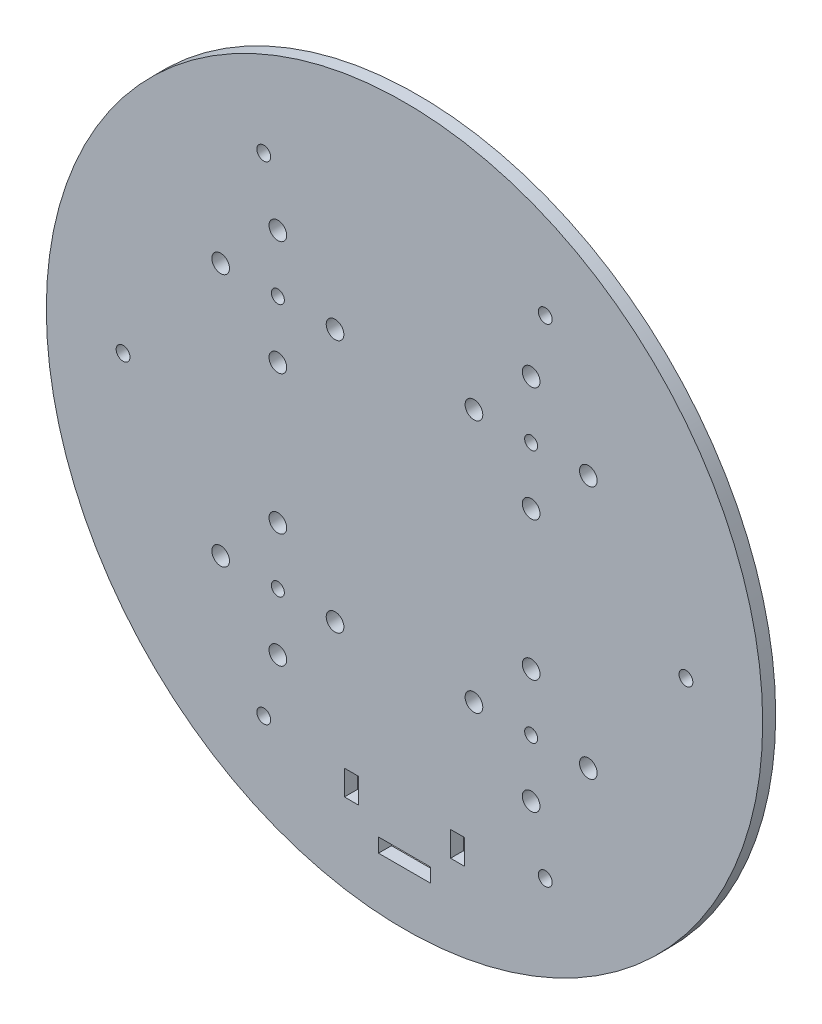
ISO-10303-21;
HEADER;
FILE_DESCRIPTION(('STEP AP214'),'2;1');
FILE_NAME('part.step','',(''),(''),'','','');
FILE_SCHEMA(('AUTOMOTIVE_DESIGN { 1 0 10303 214 1 1 1 1 }'));
ENDSEC;
DATA;
#1=APPLICATION_CONTEXT('core data for automotive mechanical design processes');
#2=APPLICATION_PROTOCOL_DEFINITION('international standard','automotive_design',2000,#1);
#3=PRODUCT_CONTEXT('',#1,'mechanical');
#4=PRODUCT('Part','Part','',(#3));
#5=PRODUCT_RELATED_PRODUCT_CATEGORY('part','',(#4));
#6=PRODUCT_DEFINITION_FORMATION('','',#4);
#7=PRODUCT_DEFINITION_CONTEXT('part definition',#1,'design');
#8=PRODUCT_DEFINITION('design','',#6,#7);
#9=PRODUCT_DEFINITION_SHAPE('','',#8);
#10=(LENGTH_UNIT() NAMED_UNIT(*) SI_UNIT(.MILLI.,.METRE.));
#11=(NAMED_UNIT(*) PLANE_ANGLE_UNIT() SI_UNIT($,.RADIAN.));
#12=(NAMED_UNIT(*) SI_UNIT($,.STERADIAN.) SOLID_ANGLE_UNIT());
#13=UNCERTAINTY_MEASURE_WITH_UNIT(LENGTH_MEASURE(1.E-05),#10,'distance_accuracy_value','');
#14=(GEOMETRIC_REPRESENTATION_CONTEXT(3) GLOBAL_UNCERTAINTY_ASSIGNED_CONTEXT((#13)) GLOBAL_UNIT_ASSIGNED_CONTEXT((#10,
#11,#12)) REPRESENTATION_CONTEXT('',''));
#15=CARTESIAN_POINT('',(0.,0.,0.));
#16=DIRECTION('',(0.,0.,1.));
#17=DIRECTION('',(1.,0.,0.));
#18=AXIS2_PLACEMENT_3D('',#15,#16,#17);
#19=CARTESIAN_POINT('',(0.,0.,0.));
#20=DIRECTION('',(0.,0.,1.));
#21=DIRECTION('',(1.,0.,0.));
#22=AXIS2_PLACEMENT_3D('',#19,#20,#21);
#23=PLANE('',#22);
#24=CARTESIAN_POINT('',(61.8718433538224,-89.8118433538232,0.));
#25=DIRECTION('',(0.,0.,1.));
#26=DIRECTION('',(1.,0.,0.));
#27=AXIS2_PLACEMENT_3D('',#24,#25,#26);
#28=CIRCLE('',#27,4.31800000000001);
#29=CARTESIAN_POINT('',(66.1898433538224,-89.8118433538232,0.));
#30=VERTEX_POINT('',#29);
#31=EDGE_CURVE('E463',#30,#30,#28,.T.);
#32=ORIENTED_EDGE('',*,*,#31,.T.);
#33=EDGE_LOOP('',(#32));
#34=FACE_BOUND('',#33,.T.);
#35=CARTESIAN_POINT('',(33.9318433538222,-61.8718433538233,0.));
#36=DIRECTION('',(0.,0.,1.));
#37=DIRECTION('',(1.,0.,0.));
#38=AXIS2_PLACEMENT_3D('',#35,#36,#37);
#39=CIRCLE('',#38,4.318);
#40=CARTESIAN_POINT('',(38.2498433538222,-61.8718433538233,0.));
#41=VERTEX_POINT('',#40);
#42=EDGE_CURVE('E455',#41,#41,#39,.T.);
#43=ORIENTED_EDGE('',*,*,#42,.T.);
#44=EDGE_LOOP('',(#43));
#45=FACE_BOUND('',#44,.T.);
#46=CARTESIAN_POINT('',(-33.9318433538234,-61.8718433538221,0.));
#47=DIRECTION('',(0.,0.,1.));
#48=DIRECTION('',(1.,0.,0.));
#49=AXIS2_PLACEMENT_3D('',#46,#47,#48);
#50=CIRCLE('',#49,4.31799999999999);
#51=CARTESIAN_POINT('',(-29.6138433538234,-61.8718433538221,0.));
#52=VERTEX_POINT('',#51);
#53=EDGE_CURVE('E447',#52,#52,#50,.T.);
#54=ORIENTED_EDGE('',*,*,#53,.T.);
#55=EDGE_LOOP('',(#54));
#56=FACE_BOUND('',#55,.T.);
#57=CARTESIAN_POINT('',(-61.8718433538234,-33.931843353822,0.));
#58=DIRECTION('',(0.,0.,1.));
#59=DIRECTION('',(1.,0.,0.));
#60=AXIS2_PLACEMENT_3D('',#57,#58,#59);
#61=CIRCLE('',#60,4.31800000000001);
#62=CARTESIAN_POINT('',(-57.5538433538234,-33.931843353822,0.));
#63=VERTEX_POINT('',#62);
#64=EDGE_CURVE('E438',#63,#63,#61,.T.);
#65=ORIENTED_EDGE('',*,*,#64,.T.);
#66=EDGE_LOOP('',(#65));
#67=FACE_BOUND('',#66,.T.);
#68=CARTESIAN_POINT('',(-61.8718433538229,-61.871843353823,0.));
#69=DIRECTION('',(0.,0.,1.));
#70=DIRECTION('',(1.,0.,0.));
#71=AXIS2_PLACEMENT_3D('',#68,#69,#70);
#72=CIRCLE('',#71,3.175);
#73=CARTESIAN_POINT('',(-58.6968433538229,-61.871843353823,0.));
#74=VERTEX_POINT('',#73);
#75=EDGE_CURVE('E486',#74,#74,#72,.T.);
#76=ORIENTED_EDGE('',*,*,#75,.T.);
#77=EDGE_LOOP('',(#76));
#78=FACE_BOUND('',#77,.T.);
#79=CARTESIAN_POINT('',(61.8718433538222,-33.9318433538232,0.));
#80=DIRECTION('',(0.,0.,1.));
#81=DIRECTION('',(1.,0.,0.));
#82=AXIS2_PLACEMENT_3D('',#79,#80,#81);
#83=CIRCLE('',#82,4.31800000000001);
#84=CARTESIAN_POINT('',(66.1898433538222,-33.9318433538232,0.));
#85=VERTEX_POINT('',#84);
#86=EDGE_CURVE('E495',#85,#85,#83,.T.);
#87=ORIENTED_EDGE('',*,*,#86,.T.);
#88=EDGE_LOOP('',(#87));
#89=FACE_BOUND('',#88,.T.);
#90=CARTESIAN_POINT('',(-61.8718433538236,-89.811843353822,0.));
#91=DIRECTION('',(0.,0.,1.));
#92=DIRECTION('',(1.,0.,0.));
#93=AXIS2_PLACEMENT_3D('',#90,#91,#92);
#94=CIRCLE('',#93,4.31799999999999);
#95=CARTESIAN_POINT('',(-57.5538433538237,-89.811843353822,0.));
#96=VERTEX_POINT('',#95);
#97=EDGE_CURVE('E470',#96,#96,#94,.T.);
#98=ORIENTED_EDGE('',*,*,#97,.T.);
#99=EDGE_LOOP('',(#98));
#100=FACE_BOUND('',#99,.T.);
#101=CARTESIAN_POINT('',(-89.8118433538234,-61.8718433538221,0.));
#102=DIRECTION('',(0.,0.,1.));
#103=DIRECTION('',(1.,0.,0.));
#104=AXIS2_PLACEMENT_3D('',#101,#102,#103);
#105=CIRCLE('',#104,4.31799999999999);
#106=CARTESIAN_POINT('',(-85.4938433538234,-61.8718433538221,0.));
#107=VERTEX_POINT('',#106);
#108=EDGE_CURVE('E479',#107,#107,#105,.T.);
#109=ORIENTED_EDGE('',*,*,#108,.T.);
#110=EDGE_LOOP('',(#109));
#111=FACE_BOUND('',#110,.T.);
#112=CARTESIAN_POINT('',(-89.8118433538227,61.8718433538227,0.));
#113=DIRECTION('',(0.,0.,1.));
#114=DIRECTION('',(1.,0.,0.));
#115=AXIS2_PLACEMENT_3D('',#112,#113,#114);
#116=CIRCLE('',#115,4.31799999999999);
#117=CARTESIAN_POINT('',(-85.4938433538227,61.8718433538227,0.));
#118=VERTEX_POINT('',#117);
#119=EDGE_CURVE('E399',#118,#118,#116,.T.);
#120=ORIENTED_EDGE('',*,*,#119,.T.);
#121=EDGE_LOOP('',(#120));
#122=FACE_BOUND('',#121,.T.);
#123=CARTESIAN_POINT('',(-61.8718433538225,33.9318433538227,0.));
#124=DIRECTION('',(0.,0.,1.));
#125=DIRECTION('',(1.,0.,0.));
#126=AXIS2_PLACEMENT_3D('',#123,#124,#125);
#127=CIRCLE('',#126,4.31800000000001);
#128=CARTESIAN_POINT('',(-57.5538433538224,33.9318433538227,0.));
#129=VERTEX_POINT('',#128);
#130=EDGE_CURVE('E391',#129,#129,#127,.T.);
#131=ORIENTED_EDGE('',*,*,#130,.T.);
#132=EDGE_LOOP('',(#131));
#133=FACE_BOUND('',#132,.T.);
#134=CARTESIAN_POINT('',(-33.9318433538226,61.8718433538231,0.));
#135=DIRECTION('',(0.,0.,1.));
#136=DIRECTION('',(1.,0.,0.));
#137=AXIS2_PLACEMENT_3D('',#134,#135,#136);
#138=CIRCLE('',#137,4.31800000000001);
#139=CARTESIAN_POINT('',(-29.6138433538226,61.8718433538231,0.));
#140=VERTEX_POINT('',#139);
#141=EDGE_CURVE('E383',#140,#140,#138,.T.);
#142=ORIENTED_EDGE('',*,*,#141,.T.);
#143=EDGE_LOOP('',(#142));
#144=FACE_BOUND('',#143,.T.);
#145=CARTESIAN_POINT('',(61.871843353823,89.8118433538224,0.));
#146=DIRECTION('',(0.,0.,1.));
#147=DIRECTION('',(1.,0.,0.));
#148=AXIS2_PLACEMENT_3D('',#145,#146,#147);
#149=CIRCLE('',#148,4.31799999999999);
#150=CARTESIAN_POINT('',(66.189843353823,89.8118433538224,0.));
#151=VERTEX_POINT('',#150);
#152=EDGE_CURVE('E374',#151,#151,#149,.T.);
#153=ORIENTED_EDGE('',*,*,#152,.T.);
#154=EDGE_LOOP('',(#153));
#155=FACE_BOUND('',#154,.T.);
#156=CARTESIAN_POINT('',(33.931843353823,61.8718433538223,0.));
#157=DIRECTION('',(0.,0.,1.));
#158=DIRECTION('',(1.,0.,0.));
#159=AXIS2_PLACEMENT_3D('',#156,#157,#158);
#160=CIRCLE('',#159,4.31800000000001);
#161=CARTESIAN_POINT('',(38.249843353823,61.8718433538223,0.));
#162=VERTEX_POINT('',#161);
#163=EDGE_CURVE('E431',#162,#162,#160,.T.);
#164=ORIENTED_EDGE('',*,*,#163,.T.);
#165=EDGE_LOOP('',(#164));
#166=FACE_BOUND('',#165,.T.);
#167=CARTESIAN_POINT('',(89.811843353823,61.8718433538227,0.));
#168=DIRECTION('',(0.,0.,1.));
#169=DIRECTION('',(1.,0.,0.));
#170=AXIS2_PLACEMENT_3D('',#167,#168,#169);
#171=CIRCLE('',#170,4.31800000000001);
#172=CARTESIAN_POINT('',(94.129843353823,61.8718433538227,0.));
#173=VERTEX_POINT('',#172);
#174=EDGE_CURVE('E423',#173,#173,#171,.T.);
#175=ORIENTED_EDGE('',*,*,#174,.T.);
#176=EDGE_LOOP('',(#175));
#177=FACE_BOUND('',#176,.T.);
#178=CARTESIAN_POINT('',(61.8718433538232,33.9318433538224,0.));
#179=DIRECTION('',(0.,0.,1.));
#180=DIRECTION('',(1.,0.,0.));
#181=AXIS2_PLACEMENT_3D('',#178,#179,#180);
#182=CIRCLE('',#181,4.31800000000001);
#183=CARTESIAN_POINT('',(66.1898433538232,33.9318433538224,0.));
#184=VERTEX_POINT('',#183);
#185=EDGE_CURVE('E415',#184,#184,#182,.T.);
#186=ORIENTED_EDGE('',*,*,#185,.T.);
#187=EDGE_LOOP('',(#186));
#188=FACE_BOUND('',#187,.T.);
#189=CARTESIAN_POINT('',(89.8118433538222,-61.8718433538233,0.));
#190=DIRECTION('',(0.,0.,1.));
#191=DIRECTION('',(1.,0.,0.));
#192=AXIS2_PLACEMENT_3D('',#189,#190,#191);
#193=CIRCLE('',#192,4.318);
#194=CARTESIAN_POINT('',(94.1298433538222,-61.8718433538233,0.));
#195=VERTEX_POINT('',#194);
#196=EDGE_CURVE('E406',#195,#195,#193,.T.);
#197=ORIENTED_EDGE('',*,*,#196,.T.);
#198=EDGE_LOOP('',(#197));
#199=FACE_BOUND('',#198,.T.);
#200=CARTESIAN_POINT('',(61.871843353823,61.8718433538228,0.));
#201=DIRECTION('',(0.,0.,1.));
#202=DIRECTION('',(1.,0.,0.));
#203=AXIS2_PLACEMENT_3D('',#200,#201,#202);
#204=CIRCLE('',#203,3.17499999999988);
#205=CARTESIAN_POINT('',(65.0468433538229,61.8718433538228,0.));
#206=VERTEX_POINT('',#205);
#207=EDGE_CURVE('E518',#206,#206,#204,.T.);
#208=ORIENTED_EDGE('',*,*,#207,.T.);
#209=EDGE_LOOP('',(#208));
#210=FACE_BOUND('',#209,.T.);
#211=CARTESIAN_POINT('',(61.8718433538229,-61.871843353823,0.));
#212=DIRECTION('',(0.,0.,1.));
#213=DIRECTION('',(1.,0.,0.));
#214=AXIS2_PLACEMENT_3D('',#211,#212,#213);
#215=CIRCLE('',#214,3.17500000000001);
#216=CARTESIAN_POINT('',(65.0468433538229,-61.871843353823,0.));
#217=VERTEX_POINT('',#216);
#218=EDGE_CURVE('E502',#217,#217,#215,.T.);
#219=ORIENTED_EDGE('',*,*,#218,.T.);
#220=EDGE_LOOP('',(#219));
#221=FACE_BOUND('',#220,.T.);
#222=CARTESIAN_POINT('',(-61.871843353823,61.8718433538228,0.));
#223=DIRECTION('',(0.,0.,1.));
#224=DIRECTION('',(1.,0.,0.));
#225=AXIS2_PLACEMENT_3D('',#222,#223,#224);
#226=CIRCLE('',#225,3.175);
#227=CARTESIAN_POINT('',(-58.696843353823,61.8718433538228,0.));
#228=VERTEX_POINT('',#227);
#229=EDGE_CURVE('E511',#228,#228,#226,.T.);
#230=ORIENTED_EDGE('',*,*,#229,.T.);
#231=EDGE_LOOP('',(#230));
#232=FACE_BOUND('',#231,.T.);
#233=CARTESIAN_POINT('',(-61.871843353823,89.8118433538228,0.));
#234=DIRECTION('',(0.,0.,1.));
#235=DIRECTION('',(1.,0.,0.));
#236=AXIS2_PLACEMENT_3D('',#233,#234,#235);
#237=CIRCLE('',#236,4.318);
#238=CARTESIAN_POINT('',(-57.553843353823,89.8118433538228,0.));
#239=VERTEX_POINT('',#238);
#240=EDGE_CURVE('E225',#239,#239,#237,.T.);
#241=ORIENTED_EDGE('',*,*,#240,.T.);
#242=EDGE_LOOP('',(#241));
#243=FACE_BOUND('',#242,.T.);
#244=DIRECTION('',(1.,0.,0.));
#245=VECTOR('',#244,1.);
#246=CARTESIAN_POINT('',(0.,-142.24999999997,0.));
#247=LINE('',#246,#245);
#248=CARTESIAN_POINT('',(-12.7000918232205,-142.24999999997,0.));
#249=VERTEX_POINT('',#248);
#250=CARTESIAN_POINT('',(12.6999081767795,-142.24999999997,0.));
#251=VERTEX_POINT('',#250);
#252=EDGE_CURVE('E273',#249,#251,#247,.T.);
#253=ORIENTED_EDGE('',*,*,#252,.F.);
#254=DIRECTION('',(0.,-1.,0.));
#255=VECTOR('',#254,1.);
#256=CARTESIAN_POINT('',(-12.7000918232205,0.,0.));
#257=LINE('',#256,#255);
#258=CARTESIAN_POINT('',(-12.7000918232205,-149.108014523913,0.));
#259=VERTEX_POINT('',#258);
#260=EDGE_CURVE('E262',#249,#259,#257,.T.);
#261=ORIENTED_EDGE('',*,*,#260,.T.);
#262=DIRECTION('',(1.,0.,0.));
#263=VECTOR('',#262,1.);
#264=CARTESIAN_POINT('',(0.,-149.108014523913,0.));
#265=LINE('',#264,#263);
#266=CARTESIAN_POINT('',(12.6999081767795,-149.108014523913,0.));
#267=VERTEX_POINT('',#266);
#268=EDGE_CURVE('E266',#259,#267,#265,.T.);
#269=ORIENTED_EDGE('',*,*,#268,.T.);
#270=DIRECTION('',(0.,-1.,0.));
#271=VECTOR('',#270,1.);
#272=CARTESIAN_POINT('',(12.6999081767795,0.,0.));
#273=LINE('',#272,#271);
#274=EDGE_CURVE('E270',#251,#267,#273,.T.);
#275=ORIENTED_EDGE('',*,*,#274,.F.);
#276=EDGE_LOOP('',(#253,#261,#269,#275));
#277=FACE_BOUND('',#276,.T.);
#278=CARTESIAN_POINT('',(0.,0.,0.));
#279=DIRECTION('',(0.,0.,1.));
#280=DIRECTION('',(1.,0.,0.));
#281=AXIS2_PLACEMENT_3D('',#278,#279,#280);
#282=CIRCLE('',#281,175.);
#283=CARTESIAN_POINT('',(175.,0.,0.));
#284=VERTEX_POINT('',#283);
#285=EDGE_CURVE('E66',#284,#284,#282,.T.);
#286=ORIENTED_EDGE('',*,*,#285,.F.);
#287=EDGE_LOOP('',(#286));
#288=FACE_BOUND('',#287,.T.);
#289=CARTESIAN_POINT('',(68.7499999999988,-119.078493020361,0.));
#290=DIRECTION('',(0.,0.,1.));
#291=DIRECTION('',(1.,0.,0.));
#292=AXIS2_PLACEMENT_3D('',#289,#290,#291);
#293=CIRCLE('',#292,3.375);
#294=CARTESIAN_POINT('',(72.1249999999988,-119.078493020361,0.));
#295=VERTEX_POINT('',#294);
#296=EDGE_CURVE('E329',#295,#295,#293,.T.);
#297=ORIENTED_EDGE('',*,*,#296,.T.);
#298=EDGE_LOOP('',(#297));
#299=FACE_BOUND('',#298,.T.);
#300=CARTESIAN_POINT('',(137.5,-1.0017831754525E-12,0.));
#301=DIRECTION('',(0.,0.,1.));
#302=DIRECTION('',(1.,0.,0.));
#303=AXIS2_PLACEMENT_3D('',#300,#301,#302);
#304=CIRCLE('',#303,3.375);
#305=CARTESIAN_POINT('',(140.875,-1.0017831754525E-12,0.));
#306=VERTEX_POINT('',#305);
#307=EDGE_CURVE('E326',#306,#306,#304,.T.);
#308=ORIENTED_EDGE('',*,*,#307,.T.);
#309=EDGE_LOOP('',(#308));
#310=FACE_BOUND('',#309,.T.);
#311=CARTESIAN_POINT('',(68.7500000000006,119.07849302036,0.));
#312=DIRECTION('',(0.,0.,1.));
#313=DIRECTION('',(1.,0.,0.));
#314=AXIS2_PLACEMENT_3D('',#311,#312,#313);
#315=CIRCLE('',#314,3.375);
#316=CARTESIAN_POINT('',(72.1250000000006,119.07849302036,0.));
#317=VERTEX_POINT('',#316);
#318=EDGE_CURVE('E322',#317,#317,#315,.T.);
#319=ORIENTED_EDGE('',*,*,#318,.T.);
#320=EDGE_LOOP('',(#319));
#321=FACE_BOUND('',#320,.T.);
#322=CARTESIAN_POINT('',(-68.7499999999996,119.07849302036,0.));
#323=DIRECTION('',(0.,0.,1.));
#324=DIRECTION('',(1.,0.,0.));
#325=AXIS2_PLACEMENT_3D('',#322,#323,#324);
#326=CIRCLE('',#325,3.375);
#327=CARTESIAN_POINT('',(-65.3749999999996,119.07849302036,0.));
#328=VERTEX_POINT('',#327);
#329=EDGE_CURVE('E318',#328,#328,#326,.T.);
#330=ORIENTED_EDGE('',*,*,#329,.T.);
#331=EDGE_LOOP('',(#330));
#332=FACE_BOUND('',#331,.T.);
#333=CARTESIAN_POINT('',(-137.5,0.,0.));
#334=DIRECTION('',(0.,0.,1.));
#335=DIRECTION('',(1.,0.,0.));
#336=AXIS2_PLACEMENT_3D('',#333,#334,#335);
#337=CIRCLE('',#336,3.375);
#338=CARTESIAN_POINT('',(-134.125,0.,0.));
#339=VERTEX_POINT('',#338);
#340=EDGE_CURVE('E314',#339,#339,#337,.T.);
#341=ORIENTED_EDGE('',*,*,#340,.T.);
#342=EDGE_LOOP('',(#341));
#343=FACE_BOUND('',#342,.T.);
#344=CARTESIAN_POINT('',(-68.7500000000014,-119.07849302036,0.));
#345=DIRECTION('',(0.,0.,1.));
#346=DIRECTION('',(1.,0.,0.));
#347=AXIS2_PLACEMENT_3D('',#344,#345,#346);
#348=CIRCLE('',#347,3.375);
#349=CARTESIAN_POINT('',(-65.3750000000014,-119.07849302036,0.));
#350=VERTEX_POINT('',#349);
#351=EDGE_CURVE('E287',#350,#350,#348,.T.);
#352=ORIENTED_EDGE('',*,*,#351,.T.);
#353=EDGE_LOOP('',(#352));
#354=FACE_BOUND('',#353,.T.);
#355=DIRECTION('',(-1.,0.,0.));
#356=VECTOR('',#355,1.);
#357=CARTESIAN_POINT('',(0.,-133.65,0.));
#358=LINE('',#357,#356);
#359=CARTESIAN_POINT('',(29.358,-133.65,0.));
#360=VERTEX_POINT('',#359);
#361=CARTESIAN_POINT('',(22.5,-133.65,0.));
#362=VERTEX_POINT('',#361);
#363=EDGE_CURVE('E259',#360,#362,#358,.T.);
#364=ORIENTED_EDGE('',*,*,#363,.F.);
#365=DIRECTION('',(0.,-1.,0.));
#366=VECTOR('',#365,1.);
#367=CARTESIAN_POINT('',(29.3580000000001,0.,0.));
#368=LINE('',#367,#366);
#369=CARTESIAN_POINT('',(29.358,-121.458,0.));
#370=VERTEX_POINT('',#369);
#371=EDGE_CURVE('E187',#370,#360,#368,.T.);
#372=ORIENTED_EDGE('',*,*,#371,.F.);
#373=DIRECTION('',(-1.,0.,0.));
#374=VECTOR('',#373,1.);
#375=CARTESIAN_POINT('',(0.,-121.458,0.));
#376=LINE('',#375,#374);
#377=CARTESIAN_POINT('',(22.5,-121.458,0.));
#378=VERTEX_POINT('',#377);
#379=EDGE_CURVE('E251',#370,#378,#376,.T.);
#380=ORIENTED_EDGE('',*,*,#379,.T.);
#381=DIRECTION('',(0.,-1.,0.));
#382=VECTOR('',#381,1.);
#383=CARTESIAN_POINT('',(22.4999999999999,0.,0.));
#384=LINE('',#383,#382);
#385=EDGE_CURVE('E255',#378,#362,#384,.T.);
#386=ORIENTED_EDGE('',*,*,#385,.T.);
#387=EDGE_LOOP('',(#364,#372,#380,#386));
#388=FACE_BOUND('',#387,.T.);
#389=DIRECTION('',(1.,0.,0.));
#390=VECTOR('',#389,1.);
#391=CARTESIAN_POINT('',(0.,-121.458,0.));
#392=LINE('',#391,#390);
#393=CARTESIAN_POINT('',(-29.358,-121.458,0.));
#394=VERTEX_POINT('',#393);
#395=CARTESIAN_POINT('',(-22.5,-121.458,0.));
#396=VERTEX_POINT('',#395);
#397=EDGE_CURVE('E284',#394,#396,#392,.T.);
#398=ORIENTED_EDGE('',*,*,#397,.F.);
#399=DIRECTION('',(0.,-1.,0.));
#400=VECTOR('',#399,1.);
#401=CARTESIAN_POINT('',(-29.358,0.,0.));
#402=LINE('',#401,#400);
#403=CARTESIAN_POINT('',(-29.358,-133.65,0.));
#404=VERTEX_POINT('',#403);
#405=EDGE_CURVE('E276',#394,#404,#402,.T.);
#406=ORIENTED_EDGE('',*,*,#405,.T.);
#407=DIRECTION('',(1.,0.,0.));
#408=VECTOR('',#407,1.);
#409=CARTESIAN_POINT('',(0.,-133.65,0.));
#410=LINE('',#409,#408);
#411=CARTESIAN_POINT('',(-22.5,-133.65,0.));
#412=VERTEX_POINT('',#411);
#413=EDGE_CURVE('E159',#404,#412,#410,.T.);
#414=ORIENTED_EDGE('',*,*,#413,.T.);
#415=DIRECTION('',(0.,-1.,0.));
#416=VECTOR('',#415,1.);
#417=CARTESIAN_POINT('',(-22.5,0.,0.));
#418=LINE('',#417,#416);
#419=EDGE_CURVE('E281',#396,#412,#418,.T.);
#420=ORIENTED_EDGE('',*,*,#419,.F.);
#421=EDGE_LOOP('',(#398,#406,#414,#420));
#422=FACE_BOUND('',#421,.T.);
#423=ADVANCED_FACE('F62',(#34,#45,#56,#67,#78,#89,#100,#111,#122,#133,#144,#155,#166,#177,#188,
#199,#210,#221,#232,#243,#277,#288,#299,#310,#321,#332,#343,#354,#388,#422),#23,.F.);
#424=CARTESIAN_POINT('',(0.,0.,6.35));
#425=DIRECTION('',(0.,0.,1.));
#426=DIRECTION('',(1.,0.,0.));
#427=AXIS2_PLACEMENT_3D('',#424,#425,#426);
#428=PLANE('',#427);
#429=CARTESIAN_POINT('',(61.8718433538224,-89.8118433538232,6.35));
#430=DIRECTION('',(0.,0.,1.));
#431=DIRECTION('',(1.,0.,0.));
#432=AXIS2_PLACEMENT_3D('',#429,#430,#431);
#433=CIRCLE('',#432,4.31800000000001);
#434=CARTESIAN_POINT('',(66.1898433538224,-89.8118433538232,6.35));
#435=VERTEX_POINT('',#434);
#436=EDGE_CURVE('E411',#435,#435,#433,.T.);
#437=ORIENTED_EDGE('',*,*,#436,.F.);
#438=EDGE_LOOP('',(#437));
#439=FACE_BOUND('',#438,.T.);
#440=CARTESIAN_POINT('',(33.9318433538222,-61.8718433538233,6.35));
#441=DIRECTION('',(0.,0.,1.));
#442=DIRECTION('',(1.,0.,0.));
#443=AXIS2_PLACEMENT_3D('',#440,#441,#442);
#444=CIRCLE('',#443,4.318);
#445=CARTESIAN_POINT('',(38.2498433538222,-61.8718433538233,6.35));
#446=VERTEX_POINT('',#445);
#447=EDGE_CURVE('E459',#446,#446,#444,.T.);
#448=ORIENTED_EDGE('',*,*,#447,.F.);
#449=EDGE_LOOP('',(#448));
#450=FACE_BOUND('',#449,.T.);
#451=CARTESIAN_POINT('',(-33.9318433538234,-61.8718433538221,6.35));
#452=DIRECTION('',(0.,0.,1.));
#453=DIRECTION('',(1.,0.,0.));
#454=AXIS2_PLACEMENT_3D('',#451,#452,#453);
#455=CIRCLE('',#454,4.31799999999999);
#456=CARTESIAN_POINT('',(-29.6138433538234,-61.8718433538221,6.35));
#457=VERTEX_POINT('',#456);
#458=EDGE_CURVE('E451',#457,#457,#455,.T.);
#459=ORIENTED_EDGE('',*,*,#458,.F.);
#460=EDGE_LOOP('',(#459));
#461=FACE_BOUND('',#460,.T.);
#462=CARTESIAN_POINT('',(-61.8718433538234,-33.931843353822,6.35));
#463=DIRECTION('',(0.,0.,1.));
#464=DIRECTION('',(1.,0.,0.));
#465=AXIS2_PLACEMENT_3D('',#462,#463,#464);
#466=CIRCLE('',#465,4.31800000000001);
#467=CARTESIAN_POINT('',(-57.5538433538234,-33.931843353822,6.35));
#468=VERTEX_POINT('',#467);
#469=EDGE_CURVE('E442',#468,#468,#466,.T.);
#470=ORIENTED_EDGE('',*,*,#469,.F.);
#471=EDGE_LOOP('',(#470));
#472=FACE_BOUND('',#471,.T.);
#473=CARTESIAN_POINT('',(-61.8718433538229,-61.871843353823,6.35));
#474=DIRECTION('',(0.,0.,1.));
#475=DIRECTION('',(1.,0.,0.));
#476=AXIS2_PLACEMENT_3D('',#473,#474,#475);
#477=CIRCLE('',#476,3.175);
#478=CARTESIAN_POINT('',(-58.6968433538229,-61.871843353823,6.35));
#479=VERTEX_POINT('',#478);
#480=EDGE_CURVE('E490',#479,#479,#477,.T.);
#481=ORIENTED_EDGE('',*,*,#480,.F.);
#482=EDGE_LOOP('',(#481));
#483=FACE_BOUND('',#482,.T.);
#484=CARTESIAN_POINT('',(61.8718433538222,-33.9318433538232,6.35));
#485=DIRECTION('',(0.,0.,1.));
#486=DIRECTION('',(1.,0.,0.));
#487=AXIS2_PLACEMENT_3D('',#484,#485,#486);
#488=CIRCLE('',#487,4.31800000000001);
#489=CARTESIAN_POINT('',(66.1898433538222,-33.9318433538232,6.35));
#490=VERTEX_POINT('',#489);
#491=EDGE_CURVE('E475',#490,#490,#488,.T.);
#492=ORIENTED_EDGE('',*,*,#491,.F.);
#493=EDGE_LOOP('',(#492));
#494=FACE_BOUND('',#493,.T.);
#495=CARTESIAN_POINT('',(-61.8718433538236,-89.811843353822,6.35));
#496=DIRECTION('',(0.,0.,1.));
#497=DIRECTION('',(1.,0.,0.));
#498=AXIS2_PLACEMENT_3D('',#495,#496,#497);
#499=CIRCLE('',#498,4.31799999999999);
#500=CARTESIAN_POINT('',(-57.5538433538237,-89.811843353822,6.35));
#501=VERTEX_POINT('',#500);
#502=EDGE_CURVE('E474',#501,#501,#499,.T.);
#503=ORIENTED_EDGE('',*,*,#502,.F.);
#504=EDGE_LOOP('',(#503));
#505=FACE_BOUND('',#504,.T.);
#506=CARTESIAN_POINT('',(-89.8118433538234,-61.8718433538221,6.35));
#507=DIRECTION('',(0.,0.,1.));
#508=DIRECTION('',(1.,0.,0.));
#509=AXIS2_PLACEMENT_3D('',#506,#507,#508);
#510=CIRCLE('',#509,4.31799999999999);
#511=CARTESIAN_POINT('',(-85.4938433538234,-61.8718433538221,6.35));
#512=VERTEX_POINT('',#511);
#513=EDGE_CURVE('E443',#512,#512,#510,.T.);
#514=ORIENTED_EDGE('',*,*,#513,.F.);
#515=EDGE_LOOP('',(#514));
#516=FACE_BOUND('',#515,.T.);
#517=CARTESIAN_POINT('',(-89.8118433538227,61.8718433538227,6.35));
#518=DIRECTION('',(0.,0.,1.));
#519=DIRECTION('',(1.,0.,0.));
#520=AXIS2_PLACEMENT_3D('',#517,#518,#519);
#521=CIRCLE('',#520,4.31799999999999);
#522=CARTESIAN_POINT('',(-85.4938433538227,61.8718433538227,6.35));
#523=VERTEX_POINT('',#522);
#524=EDGE_CURVE('E370',#523,#523,#521,.T.);
#525=ORIENTED_EDGE('',*,*,#524,.F.);
#526=EDGE_LOOP('',(#525));
#527=FACE_BOUND('',#526,.T.);
#528=CARTESIAN_POINT('',(-61.8718433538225,33.9318433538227,6.35));
#529=DIRECTION('',(0.,0.,1.));
#530=DIRECTION('',(1.,0.,0.));
#531=AXIS2_PLACEMENT_3D('',#528,#529,#530);
#532=CIRCLE('',#531,4.31800000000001);
#533=CARTESIAN_POINT('',(-57.5538433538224,33.9318433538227,6.35));
#534=VERTEX_POINT('',#533);
#535=EDGE_CURVE('E395',#534,#534,#532,.T.);
#536=ORIENTED_EDGE('',*,*,#535,.F.);
#537=EDGE_LOOP('',(#536));
#538=FACE_BOUND('',#537,.T.);
#539=CARTESIAN_POINT('',(-33.9318433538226,61.8718433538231,6.35));
#540=DIRECTION('',(0.,0.,1.));
#541=DIRECTION('',(1.,0.,0.));
#542=AXIS2_PLACEMENT_3D('',#539,#540,#541);
#543=CIRCLE('',#542,4.31800000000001);
#544=CARTESIAN_POINT('',(-29.6138433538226,61.8718433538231,6.35));
#545=VERTEX_POINT('',#544);
#546=EDGE_CURVE('E387',#545,#545,#543,.T.);
#547=ORIENTED_EDGE('',*,*,#546,.F.);
#548=EDGE_LOOP('',(#547));
#549=FACE_BOUND('',#548,.T.);
#550=CARTESIAN_POINT('',(61.871843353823,89.8118433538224,6.35));
#551=DIRECTION('',(0.,0.,1.));
#552=DIRECTION('',(1.,0.,0.));
#553=AXIS2_PLACEMENT_3D('',#550,#551,#552);
#554=CIRCLE('',#553,4.31799999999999);
#555=CARTESIAN_POINT('',(66.189843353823,89.8118433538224,6.35));
#556=VERTEX_POINT('',#555);
#557=EDGE_CURVE('E378',#556,#556,#554,.T.);
#558=ORIENTED_EDGE('',*,*,#557,.F.);
#559=EDGE_LOOP('',(#558));
#560=FACE_BOUND('',#559,.T.);
#561=CARTESIAN_POINT('',(33.931843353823,61.8718433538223,6.35));
#562=DIRECTION('',(0.,0.,1.));
#563=DIRECTION('',(1.,0.,0.));
#564=AXIS2_PLACEMENT_3D('',#561,#562,#563);
#565=CIRCLE('',#564,4.31800000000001);
#566=CARTESIAN_POINT('',(38.249843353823,61.8718433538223,6.35));
#567=VERTEX_POINT('',#566);
#568=EDGE_CURVE('E379',#567,#567,#565,.T.);
#569=ORIENTED_EDGE('',*,*,#568,.F.);
#570=EDGE_LOOP('',(#569));
#571=FACE_BOUND('',#570,.T.);
#572=CARTESIAN_POINT('',(89.811843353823,61.8718433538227,6.35));
#573=DIRECTION('',(0.,0.,1.));
#574=DIRECTION('',(1.,0.,0.));
#575=AXIS2_PLACEMENT_3D('',#572,#573,#574);
#576=CIRCLE('',#575,4.31800000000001);
#577=CARTESIAN_POINT('',(94.129843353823,61.8718433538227,6.35));
#578=VERTEX_POINT('',#577);
#579=EDGE_CURVE('E427',#578,#578,#576,.T.);
#580=ORIENTED_EDGE('',*,*,#579,.F.);
#581=EDGE_LOOP('',(#580));
#582=FACE_BOUND('',#581,.T.);
#583=CARTESIAN_POINT('',(61.8718433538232,33.9318433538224,6.35));
#584=DIRECTION('',(0.,0.,1.));
#585=DIRECTION('',(1.,0.,0.));
#586=AXIS2_PLACEMENT_3D('',#583,#584,#585);
#587=CIRCLE('',#586,4.31800000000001);
#588=CARTESIAN_POINT('',(66.1898433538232,33.9318433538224,6.35));
#589=VERTEX_POINT('',#588);
#590=EDGE_CURVE('E419',#589,#589,#587,.T.);
#591=ORIENTED_EDGE('',*,*,#590,.F.);
#592=EDGE_LOOP('',(#591));
#593=FACE_BOUND('',#592,.T.);
#594=CARTESIAN_POINT('',(89.8118433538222,-61.8718433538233,6.35));
#595=DIRECTION('',(0.,0.,1.));
#596=DIRECTION('',(1.,0.,0.));
#597=AXIS2_PLACEMENT_3D('',#594,#595,#596);
#598=CIRCLE('',#597,4.318);
#599=CARTESIAN_POINT('',(94.1298433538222,-61.8718433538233,6.35));
#600=VERTEX_POINT('',#599);
#601=EDGE_CURVE('E410',#600,#600,#598,.T.);
#602=ORIENTED_EDGE('',*,*,#601,.F.);
#603=EDGE_LOOP('',(#602));
#604=FACE_BOUND('',#603,.T.);
#605=CARTESIAN_POINT('',(61.871843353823,61.8718433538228,6.35));
#606=DIRECTION('',(0.,0.,1.));
#607=DIRECTION('',(1.,0.,0.));
#608=AXIS2_PLACEMENT_3D('',#605,#606,#607);
#609=CIRCLE('',#608,3.17499999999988);
#610=CARTESIAN_POINT('',(65.0468433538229,61.8718433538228,6.35));
#611=VERTEX_POINT('',#610);
#612=EDGE_CURVE('E507',#611,#611,#609,.T.);
#613=ORIENTED_EDGE('',*,*,#612,.F.);
#614=EDGE_LOOP('',(#613));
#615=FACE_BOUND('',#614,.T.);
#616=CARTESIAN_POINT('',(61.8718433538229,-61.871843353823,6.35));
#617=DIRECTION('',(0.,0.,1.));
#618=DIRECTION('',(1.,0.,0.));
#619=AXIS2_PLACEMENT_3D('',#616,#617,#618);
#620=CIRCLE('',#619,3.17500000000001);
#621=CARTESIAN_POINT('',(65.0468433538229,-61.871843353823,6.35));
#622=VERTEX_POINT('',#621);
#623=EDGE_CURVE('E506',#622,#622,#620,.T.);
#624=ORIENTED_EDGE('',*,*,#623,.F.);
#625=EDGE_LOOP('',(#624));
#626=FACE_BOUND('',#625,.T.);
#627=CARTESIAN_POINT('',(-61.871843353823,61.8718433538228,6.35));
#628=DIRECTION('',(0.,0.,1.));
#629=DIRECTION('',(1.,0.,0.));
#630=AXIS2_PLACEMENT_3D('',#627,#628,#629);
#631=CIRCLE('',#630,3.175);
#632=CARTESIAN_POINT('',(-58.696843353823,61.8718433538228,6.35));
#633=VERTEX_POINT('',#632);
#634=EDGE_CURVE('E491',#633,#633,#631,.T.);
#635=ORIENTED_EDGE('',*,*,#634,.F.);
#636=EDGE_LOOP('',(#635));
#637=FACE_BOUND('',#636,.T.);
#638=CARTESIAN_POINT('',(-61.871843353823,89.8118433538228,6.35));
#639=DIRECTION('',(0.,0.,1.));
#640=DIRECTION('',(1.,0.,0.));
#641=AXIS2_PLACEMENT_3D('',#638,#639,#640);
#642=CIRCLE('',#641,4.318);
#643=CARTESIAN_POINT('',(-57.553843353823,89.8118433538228,6.35));
#644=VERTEX_POINT('',#643);
#645=EDGE_CURVE('E366',#644,#644,#642,.T.);
#646=ORIENTED_EDGE('',*,*,#645,.F.);
#647=EDGE_LOOP('',(#646));
#648=FACE_BOUND('',#647,.T.);
#649=CARTESIAN_POINT('',(-68.7500000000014,-119.07849302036,6.35));
#650=DIRECTION('',(0.,0.,1.));
#651=DIRECTION('',(1.,0.,0.));
#652=AXIS2_PLACEMENT_3D('',#649,#650,#651);
#653=CIRCLE('',#652,3.375);
#654=CARTESIAN_POINT('',(-65.3750000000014,-119.07849302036,6.35));
#655=VERTEX_POINT('',#654);
#656=EDGE_CURVE('E288',#655,#655,#653,.T.);
#657=ORIENTED_EDGE('',*,*,#656,.F.);
#658=EDGE_LOOP('',(#657));
#659=FACE_BOUND('',#658,.T.);
#660=CARTESIAN_POINT('',(-137.5,0.,6.35));
#661=DIRECTION('',(0.,0.,1.));
#662=DIRECTION('',(1.,0.,0.));
#663=AXIS2_PLACEMENT_3D('',#660,#661,#662);
#664=CIRCLE('',#663,3.375);
#665=CARTESIAN_POINT('',(-134.125,0.,6.35));
#666=VERTEX_POINT('',#665);
#667=EDGE_CURVE('E292',#666,#666,#664,.T.);
#668=ORIENTED_EDGE('',*,*,#667,.F.);
#669=EDGE_LOOP('',(#668));
#670=FACE_BOUND('',#669,.T.);
#671=CARTESIAN_POINT('',(-68.7499999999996,119.07849302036,6.35));
#672=DIRECTION('',(0.,0.,1.));
#673=DIRECTION('',(1.,0.,0.));
#674=AXIS2_PLACEMENT_3D('',#671,#672,#673);
#675=CIRCLE('',#674,3.375);
#676=CARTESIAN_POINT('',(-65.3749999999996,119.07849302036,6.35));
#677=VERTEX_POINT('',#676);
#678=EDGE_CURVE('E296',#677,#677,#675,.T.);
#679=ORIENTED_EDGE('',*,*,#678,.F.);
#680=EDGE_LOOP('',(#679));
#681=FACE_BOUND('',#680,.T.);
#682=CARTESIAN_POINT('',(68.7500000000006,119.07849302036,6.35));
#683=DIRECTION('',(0.,0.,1.));
#684=DIRECTION('',(1.,0.,0.));
#685=AXIS2_PLACEMENT_3D('',#682,#683,#684);
#686=CIRCLE('',#685,3.375);
#687=CARTESIAN_POINT('',(72.1250000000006,119.07849302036,6.35));
#688=VERTEX_POINT('',#687);
#689=EDGE_CURVE('E300',#688,#688,#686,.T.);
#690=ORIENTED_EDGE('',*,*,#689,.F.);
#691=EDGE_LOOP('',(#690));
#692=FACE_BOUND('',#691,.T.);
#693=CARTESIAN_POINT('',(137.5,-1.0017831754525E-12,6.35));
#694=DIRECTION('',(0.,0.,1.));
#695=DIRECTION('',(1.,0.,0.));
#696=AXIS2_PLACEMENT_3D('',#693,#694,#695);
#697=CIRCLE('',#696,3.375);
#698=CARTESIAN_POINT('',(140.875,-1.0017831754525E-12,6.35));
#699=VERTEX_POINT('',#698);
#700=EDGE_CURVE('E304',#699,#699,#697,.T.);
#701=ORIENTED_EDGE('',*,*,#700,.F.);
#702=EDGE_LOOP('',(#701));
#703=FACE_BOUND('',#702,.T.);
#704=CARTESIAN_POINT('',(68.7499999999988,-119.078493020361,6.35));
#705=DIRECTION('',(0.,0.,1.));
#706=DIRECTION('',(1.,0.,0.));
#707=AXIS2_PLACEMENT_3D('',#704,#705,#706);
#708=CIRCLE('',#707,3.375);
#709=CARTESIAN_POINT('',(72.1249999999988,-119.078493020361,6.35));
#710=VERTEX_POINT('',#709);
#711=EDGE_CURVE('E72',#710,#710,#708,.T.);
#712=ORIENTED_EDGE('',*,*,#711,.F.);
#713=EDGE_LOOP('',(#712));
#714=FACE_BOUND('',#713,.T.);
#715=CARTESIAN_POINT('',(0.,0.,6.35));
#716=DIRECTION('',(0.,0.,1.));
#717=DIRECTION('',(1.,0.,0.));
#718=AXIS2_PLACEMENT_3D('',#715,#716,#717);
#719=CIRCLE('',#718,175.);
#720=CARTESIAN_POINT('',(175.,0.,6.35));
#721=VERTEX_POINT('',#720);
#722=EDGE_CURVE('E12',#721,#721,#719,.T.);
#723=ORIENTED_EDGE('',*,*,#722,.T.);
#724=EDGE_LOOP('',(#723));
#725=FACE_BOUND('',#724,.T.);
#726=DIRECTION('',(0.,-1.,0.));
#727=VECTOR('',#726,1.);
#728=CARTESIAN_POINT('',(29.3580000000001,0.,6.35));
#729=LINE('',#728,#727);
#730=CARTESIAN_POINT('',(29.358,-121.458,6.35));
#731=VERTEX_POINT('',#730);
#732=CARTESIAN_POINT('',(29.358,-133.65,6.35));
#733=VERTEX_POINT('',#732);
#734=EDGE_CURVE('E224',#731,#733,#729,.T.);
#735=ORIENTED_EDGE('',*,*,#734,.T.);
#736=DIRECTION('',(-1.,0.,0.));
#737=VECTOR('',#736,1.);
#738=CARTESIAN_POINT('',(0.,-133.65,6.35));
#739=LINE('',#738,#737);
#740=CARTESIAN_POINT('',(22.5,-133.65,6.35));
#741=VERTEX_POINT('',#740);
#742=EDGE_CURVE('E220',#733,#741,#739,.T.);
#743=ORIENTED_EDGE('',*,*,#742,.T.);
#744=DIRECTION('',(0.,-1.,0.));
#745=VECTOR('',#744,1.);
#746=CARTESIAN_POINT('',(22.4999999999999,0.,6.35));
#747=LINE('',#746,#745);
#748=CARTESIAN_POINT('',(22.5,-121.458,6.35));
#749=VERTEX_POINT('',#748);
#750=EDGE_CURVE('E233',#749,#741,#747,.T.);
#751=ORIENTED_EDGE('',*,*,#750,.F.);
#752=DIRECTION('',(-1.,0.,0.));
#753=VECTOR('',#752,1.);
#754=CARTESIAN_POINT('',(0.,-121.458,6.35));
#755=LINE('',#754,#753);
#756=EDGE_CURVE('E229',#731,#749,#755,.T.);
#757=ORIENTED_EDGE('',*,*,#756,.F.);
#758=EDGE_LOOP('',(#735,#743,#751,#757));
#759=FACE_BOUND('',#758,.T.);
#760=DIRECTION('',(0.,-1.,0.));
#761=VECTOR('',#760,1.);
#762=CARTESIAN_POINT('',(-12.7000918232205,0.,6.35));
#763=LINE('',#762,#761);
#764=CARTESIAN_POINT('',(-12.7000918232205,-142.24999999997,6.35));
#765=VERTEX_POINT('',#764);
#766=CARTESIAN_POINT('',(-12.7000918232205,-149.108014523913,6.35));
#767=VERTEX_POINT('',#766);
#768=EDGE_CURVE('E196',#765,#767,#763,.T.);
#769=ORIENTED_EDGE('',*,*,#768,.F.);
#770=DIRECTION('',(1.,0.,0.));
#771=VECTOR('',#770,1.);
#772=CARTESIAN_POINT('',(0.,-142.24999999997,6.35));
#773=LINE('',#772,#771);
#774=CARTESIAN_POINT('',(12.6999081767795,-142.24999999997,6.35));
#775=VERTEX_POINT('',#774);
#776=EDGE_CURVE('E192',#765,#775,#773,.T.);
#777=ORIENTED_EDGE('',*,*,#776,.T.);
#778=DIRECTION('',(0.,-1.,0.));
#779=VECTOR('',#778,1.);
#780=CARTESIAN_POINT('',(12.6999081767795,0.,6.35));
#781=LINE('',#780,#779);
#782=CARTESIAN_POINT('',(12.6999081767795,-149.108014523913,6.35));
#783=VERTEX_POINT('',#782);
#784=EDGE_CURVE('E204',#775,#783,#781,.T.);
#785=ORIENTED_EDGE('',*,*,#784,.T.);
#786=DIRECTION('',(1.,0.,0.));
#787=VECTOR('',#786,1.);
#788=CARTESIAN_POINT('',(0.,-149.108014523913,6.35));
#789=LINE('',#788,#787);
#790=EDGE_CURVE('E200',#767,#783,#789,.T.);
#791=ORIENTED_EDGE('',*,*,#790,.F.);
#792=EDGE_LOOP('',(#769,#777,#785,#791));
#793=FACE_BOUND('',#792,.T.);
#794=DIRECTION('',(0.,-1.,0.));
#795=VECTOR('',#794,1.);
#796=CARTESIAN_POINT('',(-29.358,0.,6.35));
#797=LINE('',#796,#795);
#798=CARTESIAN_POINT('',(-29.358,-121.458,6.35));
#799=VERTEX_POINT('',#798);
#800=CARTESIAN_POINT('',(-29.358,-133.65,6.35));
#801=VERTEX_POINT('',#800);
#802=EDGE_CURVE('E167',#799,#801,#797,.T.);
#803=ORIENTED_EDGE('',*,*,#802,.F.);
#804=DIRECTION('',(1.,0.,0.));
#805=VECTOR('',#804,1.);
#806=CARTESIAN_POINT('',(0.,-121.458,6.35));
#807=LINE('',#806,#805);
#808=CARTESIAN_POINT('',(-22.5,-121.458,6.35));
#809=VERTEX_POINT('',#808);
#810=EDGE_CURVE('E173',#799,#809,#807,.T.);
#811=ORIENTED_EDGE('',*,*,#810,.T.);
#812=DIRECTION('',(0.,-1.,0.));
#813=VECTOR('',#812,1.);
#814=CARTESIAN_POINT('',(-22.5,0.,6.35));
#815=LINE('',#814,#813);
#816=CARTESIAN_POINT('',(-22.5,-133.65,6.35));
#817=VERTEX_POINT('',#816);
#818=EDGE_CURVE('E177',#809,#817,#815,.T.);
#819=ORIENTED_EDGE('',*,*,#818,.T.);
#820=DIRECTION('',(1.,0.,0.));
#821=VECTOR('',#820,1.);
#822=CARTESIAN_POINT('',(0.,-133.65,6.35));
#823=LINE('',#822,#821);
#824=EDGE_CURVE('E156',#801,#817,#823,.T.);
#825=ORIENTED_EDGE('',*,*,#824,.F.);
#826=EDGE_LOOP('',(#803,#811,#819,#825));
#827=FACE_BOUND('',#826,.T.);
#828=ADVANCED_FACE('F175',(#439,#450,#461,#472,#483,#494,#505,#516,#527,#538,#549,#560,#571,
#582,#593,#604,#615,#626,#637,#648,#659,#670,#681,#692,#703,#714,#725,#759,#793,#827),#428,.T.);
#829=CARTESIAN_POINT('',(0.,0.,6.35));
#830=DIRECTION('',(0.,0.,-1.));
#831=DIRECTION('',(-1.,0.,0.));
#832=AXIS2_PLACEMENT_3D('',#829,#830,#831);
#833=CYLINDRICAL_SURFACE('',#832,175.);
#834=ORIENTED_EDGE('',*,*,#722,.F.);
#835=EDGE_LOOP('',(#834));
#836=FACE_BOUND('',#835,.T.);
#837=ORIENTED_EDGE('',*,*,#285,.T.);
#838=EDGE_LOOP('',(#837));
#839=FACE_BOUND('',#838,.T.);
#840=ADVANCED_FACE('F338',(#836,#839),#833,.T.);
#841=CARTESIAN_POINT('',(68.7499999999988,-119.078493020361,6.35));
#842=DIRECTION('',(0.,0.,-1.));
#843=DIRECTION('',(-1.,0.,0.));
#844=AXIS2_PLACEMENT_3D('',#841,#842,#843);
#845=CYLINDRICAL_SURFACE('',#844,3.375);
#846=ORIENTED_EDGE('',*,*,#711,.T.);
#847=EDGE_LOOP('',(#846));
#848=FACE_BOUND('',#847,.T.);
#849=ORIENTED_EDGE('',*,*,#296,.F.);
#850=EDGE_LOOP('',(#849));
#851=FACE_BOUND('',#850,.T.);
#852=ADVANCED_FACE('F601',(#848,#851),#845,.F.);
#853=CARTESIAN_POINT('',(137.5,-1.0017831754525E-12,6.35));
#854=DIRECTION('',(0.,0.,-1.));
#855=DIRECTION('',(-1.,0.,0.));
#856=AXIS2_PLACEMENT_3D('',#853,#854,#855);
#857=CYLINDRICAL_SURFACE('',#856,3.375);
#858=ORIENTED_EDGE('',*,*,#700,.T.);
#859=EDGE_LOOP('',(#858));
#860=FACE_BOUND('',#859,.T.);
#861=ORIENTED_EDGE('',*,*,#307,.F.);
#862=EDGE_LOOP('',(#861));
#863=FACE_BOUND('',#862,.T.);
#864=ADVANCED_FACE('F605',(#860,#863),#857,.F.);
#865=CARTESIAN_POINT('',(68.7500000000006,119.07849302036,6.35));
#866=DIRECTION('',(0.,0.,-1.));
#867=DIRECTION('',(-1.,0.,0.));
#868=AXIS2_PLACEMENT_3D('',#865,#866,#867);
#869=CYLINDRICAL_SURFACE('',#868,3.375);
#870=ORIENTED_EDGE('',*,*,#689,.T.);
#871=EDGE_LOOP('',(#870));
#872=FACE_BOUND('',#871,.T.);
#873=ORIENTED_EDGE('',*,*,#318,.F.);
#874=EDGE_LOOP('',(#873));
#875=FACE_BOUND('',#874,.T.);
#876=ADVANCED_FACE('F609',(#872,#875),#869,.F.);
#877=CARTESIAN_POINT('',(-68.7499999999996,119.07849302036,6.35));
#878=DIRECTION('',(0.,0.,-1.));
#879=DIRECTION('',(-1.,0.,0.));
#880=AXIS2_PLACEMENT_3D('',#877,#878,#879);
#881=CYLINDRICAL_SURFACE('',#880,3.375);
#882=ORIENTED_EDGE('',*,*,#678,.T.);
#883=EDGE_LOOP('',(#882));
#884=FACE_BOUND('',#883,.T.);
#885=ORIENTED_EDGE('',*,*,#329,.F.);
#886=EDGE_LOOP('',(#885));
#887=FACE_BOUND('',#886,.T.);
#888=ADVANCED_FACE('F613',(#884,#887),#881,.F.);
#889=CARTESIAN_POINT('',(-137.5,0.,6.35));
#890=DIRECTION('',(0.,0.,-1.));
#891=DIRECTION('',(-1.,0.,0.));
#892=AXIS2_PLACEMENT_3D('',#889,#890,#891);
#893=CYLINDRICAL_SURFACE('',#892,3.375);
#894=ORIENTED_EDGE('',*,*,#667,.T.);
#895=EDGE_LOOP('',(#894));
#896=FACE_BOUND('',#895,.T.);
#897=ORIENTED_EDGE('',*,*,#340,.F.);
#898=EDGE_LOOP('',(#897));
#899=FACE_BOUND('',#898,.T.);
#900=ADVANCED_FACE('F616',(#896,#899),#893,.F.);
#901=CARTESIAN_POINT('',(-68.7500000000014,-119.07849302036,6.35));
#902=DIRECTION('',(0.,0.,-1.));
#903=DIRECTION('',(-1.,0.,0.));
#904=AXIS2_PLACEMENT_3D('',#901,#902,#903);
#905=CYLINDRICAL_SURFACE('',#904,3.375);
#906=ORIENTED_EDGE('',*,*,#656,.T.);
#907=EDGE_LOOP('',(#906));
#908=FACE_BOUND('',#907,.T.);
#909=ORIENTED_EDGE('',*,*,#351,.F.);
#910=EDGE_LOOP('',(#909));
#911=FACE_BOUND('',#910,.T.);
#912=ADVANCED_FACE('F64',(#908,#911),#905,.F.);
#913=CARTESIAN_POINT('',(0.,-133.65,-3.65));
#914=DIRECTION('',(0.,1.,0.));
#915=DIRECTION('',(0.,0.,1.));
#916=AXIS2_PLACEMENT_3D('',#913,#914,#915);
#917=PLANE('',#916);
#918=ORIENTED_EDGE('',*,*,#363,.T.);
#919=DIRECTION('',(0.,0.,1.));
#920=VECTOR('',#919,1.);
#921=CARTESIAN_POINT('',(22.5,-133.65,-3.65));
#922=LINE('',#921,#920);
#923=EDGE_CURVE('E197',#362,#741,#922,.T.);
#924=ORIENTED_EDGE('',*,*,#923,.T.);
#925=ORIENTED_EDGE('',*,*,#742,.F.);
#926=DIRECTION('',(0.,0.,1.));
#927=VECTOR('',#926,1.);
#928=CARTESIAN_POINT('',(29.358,-133.65,-3.65));
#929=LINE('',#928,#927);
#930=EDGE_CURVE('E237',#360,#733,#929,.T.);
#931=ORIENTED_EDGE('',*,*,#930,.F.);
#932=EDGE_LOOP('',(#918,#924,#925,#931));
#933=FACE_BOUND('',#932,.T.);
#934=ADVANCED_FACE('F588',(#933),#917,.T.);
#935=CARTESIAN_POINT('',(22.4999999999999,0.,-3.65));
#936=DIRECTION('',(-1.,0.,0.));
#937=DIRECTION('',(0.,-1.,0.));
#938=AXIS2_PLACEMENT_3D('',#935,#936,#937);
#939=PLANE('',#938);
#940=DIRECTION('',(0.,0.,1.));
#941=VECTOR('',#940,1.);
#942=CARTESIAN_POINT('',(22.5,-121.458,-3.65));
#943=LINE('',#942,#941);
#944=EDGE_CURVE('E240',#378,#749,#943,.T.);
#945=ORIENTED_EDGE('',*,*,#944,.T.);
#946=ORIENTED_EDGE('',*,*,#750,.T.);
#947=ORIENTED_EDGE('',*,*,#923,.F.);
#948=ORIENTED_EDGE('',*,*,#385,.F.);
#949=EDGE_LOOP('',(#945,#946,#947,#948));
#950=FACE_BOUND('',#949,.T.);
#951=ADVANCED_FACE('F584',(#950),#939,.F.);
#952=CARTESIAN_POINT('',(0.,-121.458,-3.65));
#953=DIRECTION('',(0.,1.,0.));
#954=DIRECTION('',(0.,0.,1.));
#955=AXIS2_PLACEMENT_3D('',#952,#953,#954);
#956=PLANE('',#955);
#957=DIRECTION('',(0.,0.,1.));
#958=VECTOR('',#957,1.);
#959=CARTESIAN_POINT('',(29.358,-121.458,-3.65));
#960=LINE('',#959,#958);
#961=EDGE_CURVE('E243',#370,#731,#960,.T.);
#962=ORIENTED_EDGE('',*,*,#961,.T.);
#963=ORIENTED_EDGE('',*,*,#756,.T.);
#964=ORIENTED_EDGE('',*,*,#944,.F.);
#965=ORIENTED_EDGE('',*,*,#379,.F.);
#966=EDGE_LOOP('',(#962,#963,#964,#965));
#967=FACE_BOUND('',#966,.T.);
#968=ADVANCED_FACE('F587',(#967),#956,.F.);
#969=CARTESIAN_POINT('',(29.3580000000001,0.,-3.65));
#970=DIRECTION('',(-1.,0.,0.));
#971=DIRECTION('',(0.,-1.,0.));
#972=AXIS2_PLACEMENT_3D('',#969,#970,#971);
#973=PLANE('',#972);
#974=ORIENTED_EDGE('',*,*,#371,.T.);
#975=ORIENTED_EDGE('',*,*,#930,.T.);
#976=ORIENTED_EDGE('',*,*,#734,.F.);
#977=ORIENTED_EDGE('',*,*,#961,.F.);
#978=EDGE_LOOP('',(#974,#975,#976,#977));
#979=FACE_BOUND('',#978,.T.);
#980=ADVANCED_FACE('F583',(#979),#973,.T.);
#981=CARTESIAN_POINT('',(0.,-142.24999999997,-3.65));
#982=DIRECTION('',(0.,-1.,0.));
#983=DIRECTION('',(0.,0.,-1.));
#984=AXIS2_PLACEMENT_3D('',#981,#982,#983);
#985=PLANE('',#984);
#986=ORIENTED_EDGE('',*,*,#252,.T.);
#987=DIRECTION('',(0.,0.,1.));
#988=VECTOR('',#987,1.);
#989=CARTESIAN_POINT('',(12.6999081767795,-142.24999999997,-3.65));
#990=LINE('',#989,#988);
#991=EDGE_CURVE('E209',#251,#775,#990,.T.);
#992=ORIENTED_EDGE('',*,*,#991,.T.);
#993=ORIENTED_EDGE('',*,*,#776,.F.);
#994=DIRECTION('',(0.,0.,1.));
#995=VECTOR('',#994,1.);
#996=CARTESIAN_POINT('',(-12.7000918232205,-142.24999999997,-3.65));
#997=LINE('',#996,#995);
#998=EDGE_CURVE('E208',#249,#765,#997,.T.);
#999=ORIENTED_EDGE('',*,*,#998,.F.);
#1000=EDGE_LOOP('',(#986,#992,#993,#999));
#1001=FACE_BOUND('',#1000,.T.);
#1002=ADVANCED_FACE('F561',(#1001),#985,.T.);
#1003=CARTESIAN_POINT('',(12.6999081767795,0.,-3.65));
#1004=DIRECTION('',(-1.,0.,0.));
#1005=DIRECTION('',(0.,0.,1.));
#1006=AXIS2_PLACEMENT_3D('',#1003,#1004,#1005);
#1007=PLANE('',#1006);
#1008=ORIENTED_EDGE('',*,*,#274,.T.);
#1009=DIRECTION('',(0.,0.,1.));
#1010=VECTOR('',#1009,1.);
#1011=CARTESIAN_POINT('',(12.6999081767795,-149.108014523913,-3.65));
#1012=LINE('',#1011,#1010);
#1013=EDGE_CURVE('E212',#267,#783,#1012,.T.);
#1014=ORIENTED_EDGE('',*,*,#1013,.T.);
#1015=ORIENTED_EDGE('',*,*,#784,.F.);
#1016=ORIENTED_EDGE('',*,*,#991,.F.);
#1017=EDGE_LOOP('',(#1008,#1014,#1015,#1016));
#1018=FACE_BOUND('',#1017,.T.);
#1019=ADVANCED_FACE('F567',(#1018),#1007,.T.);
#1020=CARTESIAN_POINT('',(0.,-149.108014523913,-3.65));
#1021=DIRECTION('',(0.,-1.,0.));
#1022=DIRECTION('',(0.,0.,-1.));
#1023=AXIS2_PLACEMENT_3D('',#1020,#1021,#1022);
#1024=PLANE('',#1023);
#1025=DIRECTION('',(0.,0.,1.));
#1026=VECTOR('',#1025,1.);
#1027=CARTESIAN_POINT('',(-12.7000918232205,-149.108014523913,-3.65));
#1028=LINE('',#1027,#1026);
#1029=EDGE_CURVE('E88',#259,#767,#1028,.T.);
#1030=ORIENTED_EDGE('',*,*,#1029,.T.);
#1031=ORIENTED_EDGE('',*,*,#790,.T.);
#1032=ORIENTED_EDGE('',*,*,#1013,.F.);
#1033=ORIENTED_EDGE('',*,*,#268,.F.);
#1034=EDGE_LOOP('',(#1030,#1031,#1032,#1033));
#1035=FACE_BOUND('',#1034,.T.);
#1036=ADVANCED_FACE('F570',(#1035),#1024,.F.);
#1037=CARTESIAN_POINT('',(-12.7000918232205,0.,-3.65));
#1038=DIRECTION('',(-1.,0.,0.));
#1039=DIRECTION('',(0.,-1.,0.));
#1040=AXIS2_PLACEMENT_3D('',#1037,#1038,#1039);
#1041=PLANE('',#1040);
#1042=ORIENTED_EDGE('',*,*,#998,.T.);
#1043=ORIENTED_EDGE('',*,*,#768,.T.);
#1044=ORIENTED_EDGE('',*,*,#1029,.F.);
#1045=ORIENTED_EDGE('',*,*,#260,.F.);
#1046=EDGE_LOOP('',(#1042,#1043,#1044,#1045));
#1047=FACE_BOUND('',#1046,.T.);
#1048=ADVANCED_FACE('F557',(#1047),#1041,.F.);
#1049=CARTESIAN_POINT('',(0.,-121.458,-3.65));
#1050=DIRECTION('',(0.,-1.,0.));
#1051=DIRECTION('',(0.,0.,-1.));
#1052=AXIS2_PLACEMENT_3D('',#1049,#1050,#1051);
#1053=PLANE('',#1052);
#1054=ORIENTED_EDGE('',*,*,#397,.T.);
#1055=DIRECTION('',(0.,0.,1.));
#1056=VECTOR('',#1055,1.);
#1057=CARTESIAN_POINT('',(-22.5,-121.458,-3.65));
#1058=LINE('',#1057,#1056);
#1059=EDGE_CURVE('E184',#396,#809,#1058,.T.);
#1060=ORIENTED_EDGE('',*,*,#1059,.T.);
#1061=ORIENTED_EDGE('',*,*,#810,.F.);
#1062=DIRECTION('',(0.,0.,1.));
#1063=VECTOR('',#1062,1.);
#1064=CARTESIAN_POINT('',(-29.358,-121.458,-3.65));
#1065=LINE('',#1064,#1063);
#1066=EDGE_CURVE('E163',#394,#799,#1065,.T.);
#1067=ORIENTED_EDGE('',*,*,#1066,.F.);
#1068=EDGE_LOOP('',(#1054,#1060,#1061,#1067));
#1069=FACE_BOUND('',#1068,.T.);
#1070=ADVANCED_FACE('F361',(#1069),#1053,.T.);
#1071=CARTESIAN_POINT('',(-22.5,0.,-3.65));
#1072=DIRECTION('',(-1.,0.,0.));
#1073=DIRECTION('',(0.,0.,1.));
#1074=AXIS2_PLACEMENT_3D('',#1071,#1072,#1073);
#1075=PLANE('',#1074);
#1076=ORIENTED_EDGE('',*,*,#419,.T.);
#1077=DIRECTION('',(0.,0.,1.));
#1078=VECTOR('',#1077,1.);
#1079=CARTESIAN_POINT('',(-22.5,-133.65,-3.65));
#1080=LINE('',#1079,#1078);
#1081=EDGE_CURVE('E162',#412,#817,#1080,.T.);
#1082=ORIENTED_EDGE('',*,*,#1081,.T.);
#1083=ORIENTED_EDGE('',*,*,#818,.F.);
#1084=ORIENTED_EDGE('',*,*,#1059,.F.);
#1085=EDGE_LOOP('',(#1076,#1082,#1083,#1084));
#1086=FACE_BOUND('',#1085,.T.);
#1087=ADVANCED_FACE('F363',(#1086),#1075,.T.);
#1088=CARTESIAN_POINT('',(0.,-133.65,-3.65));
#1089=DIRECTION('',(0.,-1.,0.));
#1090=DIRECTION('',(0.,0.,-1.));
#1091=AXIS2_PLACEMENT_3D('',#1088,#1089,#1090);
#1092=PLANE('',#1091);
#1093=DIRECTION('',(0.,0.,1.));
#1094=VECTOR('',#1093,1.);
#1095=CARTESIAN_POINT('',(-29.358,-133.65,-3.65));
#1096=LINE('',#1095,#1094);
#1097=EDGE_CURVE('E80',#404,#801,#1096,.T.);
#1098=ORIENTED_EDGE('',*,*,#1097,.T.);
#1099=ORIENTED_EDGE('',*,*,#824,.T.);
#1100=ORIENTED_EDGE('',*,*,#1081,.F.);
#1101=ORIENTED_EDGE('',*,*,#413,.F.);
#1102=EDGE_LOOP('',(#1098,#1099,#1100,#1101));
#1103=FACE_BOUND('',#1102,.T.);
#1104=ADVANCED_FACE('F153',(#1103),#1092,.F.);
#1105=CARTESIAN_POINT('',(-29.358,0.,-3.65));
#1106=DIRECTION('',(-1.,0.,0.));
#1107=DIRECTION('',(0.,0.,1.));
#1108=AXIS2_PLACEMENT_3D('',#1105,#1106,#1107);
#1109=PLANE('',#1108);
#1110=ORIENTED_EDGE('',*,*,#1066,.T.);
#1111=ORIENTED_EDGE('',*,*,#802,.T.);
#1112=ORIENTED_EDGE('',*,*,#1097,.F.);
#1113=ORIENTED_EDGE('',*,*,#405,.F.);
#1114=EDGE_LOOP('',(#1110,#1111,#1112,#1113));
#1115=FACE_BOUND('',#1114,.T.);
#1116=ADVANCED_FACE('F168',(#1115),#1109,.F.);
#1117=CARTESIAN_POINT('',(-61.871843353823,89.8118433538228,0.));
#1118=DIRECTION('',(0.,0.,1.));
#1119=DIRECTION('',(1.,0.,0.));
#1120=AXIS2_PLACEMENT_3D('',#1117,#1118,#1119);
#1121=CYLINDRICAL_SURFACE('',#1120,4.318);
#1122=ORIENTED_EDGE('',*,*,#240,.F.);
#1123=EDGE_LOOP('',(#1122));
#1124=FACE_BOUND('',#1123,.T.);
#1125=ORIENTED_EDGE('',*,*,#645,.T.);
#1126=EDGE_LOOP('',(#1125));
#1127=FACE_BOUND('',#1126,.T.);
#1128=ADVANCED_FACE('F708',(#1124,#1127),#1121,.F.);
#1129=CARTESIAN_POINT('',(-61.871843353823,61.8718433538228,0.));
#1130=DIRECTION('',(0.,0.,1.));
#1131=DIRECTION('',(1.,0.,0.));
#1132=AXIS2_PLACEMENT_3D('',#1129,#1130,#1131);
#1133=CYLINDRICAL_SURFACE('',#1132,3.175);
#1134=ORIENTED_EDGE('',*,*,#229,.F.);
#1135=EDGE_LOOP('',(#1134));
#1136=FACE_BOUND('',#1135,.T.);
#1137=ORIENTED_EDGE('',*,*,#634,.T.);
#1138=EDGE_LOOP('',(#1137));
#1139=FACE_BOUND('',#1138,.T.);
#1140=ADVANCED_FACE('F720',(#1136,#1139),#1133,.F.);
#1141=CARTESIAN_POINT('',(61.8718433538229,-61.871843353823,0.));
#1142=DIRECTION('',(0.,0.,1.));
#1143=DIRECTION('',(1.,0.,0.));
#1144=AXIS2_PLACEMENT_3D('',#1141,#1142,#1143);
#1145=CYLINDRICAL_SURFACE('',#1144,3.17500000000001);
#1146=ORIENTED_EDGE('',*,*,#218,.F.);
#1147=EDGE_LOOP('',(#1146));
#1148=FACE_BOUND('',#1147,.T.);
#1149=ORIENTED_EDGE('',*,*,#623,.T.);
#1150=EDGE_LOOP('',(#1149));
#1151=FACE_BOUND('',#1150,.T.);
#1152=ADVANCED_FACE('F730',(#1148,#1151),#1145,.F.);
#1153=CARTESIAN_POINT('',(61.871843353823,61.8718433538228,0.));
#1154=DIRECTION('',(0.,0.,1.));
#1155=DIRECTION('',(1.,0.,0.));
#1156=AXIS2_PLACEMENT_3D('',#1153,#1154,#1155);
#1157=CYLINDRICAL_SURFACE('',#1156,3.17499999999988);
#1158=ORIENTED_EDGE('',*,*,#207,.F.);
#1159=EDGE_LOOP('',(#1158));
#1160=FACE_BOUND('',#1159,.T.);
#1161=ORIENTED_EDGE('',*,*,#612,.T.);
#1162=EDGE_LOOP('',(#1161));
#1163=FACE_BOUND('',#1162,.T.);
#1164=ADVANCED_FACE('F526',(#1160,#1163),#1157,.F.);
#1165=CARTESIAN_POINT('',(89.8118433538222,-61.8718433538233,0.));
#1166=DIRECTION('',(0.,0.,1.));
#1167=DIRECTION('',(1.,0.,0.));
#1168=AXIS2_PLACEMENT_3D('',#1165,#1166,#1167);
#1169=CYLINDRICAL_SURFACE('',#1168,4.318);
#1170=ORIENTED_EDGE('',*,*,#196,.F.);
#1171=EDGE_LOOP('',(#1170));
#1172=FACE_BOUND('',#1171,.T.);
#1173=ORIENTED_EDGE('',*,*,#601,.T.);
#1174=EDGE_LOOP('',(#1173));
#1175=FACE_BOUND('',#1174,.T.);
#1176=ADVANCED_FACE('F749',(#1172,#1175),#1169,.F.);
#1177=CARTESIAN_POINT('',(61.8718433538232,33.9318433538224,0.));
#1178=DIRECTION('',(0.,0.,1.));
#1179=DIRECTION('',(1.,0.,0.));
#1180=AXIS2_PLACEMENT_3D('',#1177,#1178,#1179);
#1181=CYLINDRICAL_SURFACE('',#1180,4.31800000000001);
#1182=ORIENTED_EDGE('',*,*,#185,.F.);
#1183=EDGE_LOOP('',(#1182));
#1184=FACE_BOUND('',#1183,.T.);
#1185=ORIENTED_EDGE('',*,*,#590,.T.);
#1186=EDGE_LOOP('',(#1185));
#1187=FACE_BOUND('',#1186,.T.);
#1188=ADVANCED_FACE('F759',(#1184,#1187),#1181,.F.);
#1189=CARTESIAN_POINT('',(89.811843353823,61.8718433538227,0.));
#1190=DIRECTION('',(0.,0.,1.));
#1191=DIRECTION('',(1.,0.,0.));
#1192=AXIS2_PLACEMENT_3D('',#1189,#1190,#1191);
#1193=CYLINDRICAL_SURFACE('',#1192,4.31800000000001);
#1194=ORIENTED_EDGE('',*,*,#174,.F.);
#1195=EDGE_LOOP('',(#1194));
#1196=FACE_BOUND('',#1195,.T.);
#1197=ORIENTED_EDGE('',*,*,#579,.T.);
#1198=EDGE_LOOP('',(#1197));
#1199=FACE_BOUND('',#1198,.T.);
#1200=ADVANCED_FACE('F769',(#1196,#1199),#1193,.F.);
#1201=CARTESIAN_POINT('',(33.931843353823,61.8718433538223,0.));
#1202=DIRECTION('',(0.,0.,1.));
#1203=DIRECTION('',(1.,0.,0.));
#1204=AXIS2_PLACEMENT_3D('',#1201,#1202,#1203);
#1205=CYLINDRICAL_SURFACE('',#1204,4.31800000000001);
#1206=ORIENTED_EDGE('',*,*,#163,.F.);
#1207=EDGE_LOOP('',(#1206));
#1208=FACE_BOUND('',#1207,.T.);
#1209=ORIENTED_EDGE('',*,*,#568,.T.);
#1210=EDGE_LOOP('',(#1209));
#1211=FACE_BOUND('',#1210,.T.);
#1212=ADVANCED_FACE('F779',(#1208,#1211),#1205,.F.);
#1213=CARTESIAN_POINT('',(61.871843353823,89.8118433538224,0.));
#1214=DIRECTION('',(0.,0.,1.));
#1215=DIRECTION('',(1.,0.,0.));
#1216=AXIS2_PLACEMENT_3D('',#1213,#1214,#1215);
#1217=CYLINDRICAL_SURFACE('',#1216,4.31799999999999);
#1218=ORIENTED_EDGE('',*,*,#152,.F.);
#1219=EDGE_LOOP('',(#1218));
#1220=FACE_BOUND('',#1219,.T.);
#1221=ORIENTED_EDGE('',*,*,#557,.T.);
#1222=EDGE_LOOP('',(#1221));
#1223=FACE_BOUND('',#1222,.T.);
#1224=ADVANCED_FACE('F789',(#1220,#1223),#1217,.F.);
#1225=CARTESIAN_POINT('',(-33.9318433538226,61.8718433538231,0.));
#1226=DIRECTION('',(0.,0.,1.));
#1227=DIRECTION('',(1.,0.,0.));
#1228=AXIS2_PLACEMENT_3D('',#1225,#1226,#1227);
#1229=CYLINDRICAL_SURFACE('',#1228,4.31800000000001);
#1230=ORIENTED_EDGE('',*,*,#141,.F.);
#1231=EDGE_LOOP('',(#1230));
#1232=FACE_BOUND('',#1231,.T.);
#1233=ORIENTED_EDGE('',*,*,#546,.T.);
#1234=EDGE_LOOP('',(#1233));
#1235=FACE_BOUND('',#1234,.T.);
#1236=ADVANCED_FACE('F799',(#1232,#1235),#1229,.F.);
#1237=CARTESIAN_POINT('',(-61.8718433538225,33.9318433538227,0.));
#1238=DIRECTION('',(0.,0.,1.));
#1239=DIRECTION('',(1.,0.,0.));
#1240=AXIS2_PLACEMENT_3D('',#1237,#1238,#1239);
#1241=CYLINDRICAL_SURFACE('',#1240,4.31800000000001);
#1242=ORIENTED_EDGE('',*,*,#130,.F.);
#1243=EDGE_LOOP('',(#1242));
#1244=FACE_BOUND('',#1243,.T.);
#1245=ORIENTED_EDGE('',*,*,#535,.T.);
#1246=EDGE_LOOP('',(#1245));
#1247=FACE_BOUND('',#1246,.T.);
#1248=ADVANCED_FACE('F809',(#1244,#1247),#1241,.F.);
#1249=CARTESIAN_POINT('',(-89.8118433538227,61.8718433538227,0.));
#1250=DIRECTION('',(0.,0.,1.));
#1251=DIRECTION('',(1.,0.,0.));
#1252=AXIS2_PLACEMENT_3D('',#1249,#1250,#1251);
#1253=CYLINDRICAL_SURFACE('',#1252,4.31799999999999);
#1254=ORIENTED_EDGE('',*,*,#119,.F.);
#1255=EDGE_LOOP('',(#1254));
#1256=FACE_BOUND('',#1255,.T.);
#1257=ORIENTED_EDGE('',*,*,#524,.T.);
#1258=EDGE_LOOP('',(#1257));
#1259=FACE_BOUND('',#1258,.T.);
#1260=ADVANCED_FACE('F819',(#1256,#1259),#1253,.F.);
#1261=CARTESIAN_POINT('',(-89.8118433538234,-61.8718433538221,0.));
#1262=DIRECTION('',(0.,0.,1.));
#1263=DIRECTION('',(1.,0.,0.));
#1264=AXIS2_PLACEMENT_3D('',#1261,#1262,#1263);
#1265=CYLINDRICAL_SURFACE('',#1264,4.31799999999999);
#1266=ORIENTED_EDGE('',*,*,#108,.F.);
#1267=EDGE_LOOP('',(#1266));
#1268=FACE_BOUND('',#1267,.T.);
#1269=ORIENTED_EDGE('',*,*,#513,.T.);
#1270=EDGE_LOOP('',(#1269));
#1271=FACE_BOUND('',#1270,.T.);
#1272=ADVANCED_FACE('F829',(#1268,#1271),#1265,.F.);
#1273=CARTESIAN_POINT('',(-61.8718433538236,-89.811843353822,0.));
#1274=DIRECTION('',(0.,0.,1.));
#1275=DIRECTION('',(1.,0.,0.));
#1276=AXIS2_PLACEMENT_3D('',#1273,#1274,#1275);
#1277=CYLINDRICAL_SURFACE('',#1276,4.31799999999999);
#1278=ORIENTED_EDGE('',*,*,#97,.F.);
#1279=EDGE_LOOP('',(#1278));
#1280=FACE_BOUND('',#1279,.T.);
#1281=ORIENTED_EDGE('',*,*,#502,.T.);
#1282=EDGE_LOOP('',(#1281));
#1283=FACE_BOUND('',#1282,.T.);
#1284=ADVANCED_FACE('F839',(#1280,#1283),#1277,.F.);
#1285=CARTESIAN_POINT('',(61.8718433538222,-33.9318433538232,0.));
#1286=DIRECTION('',(0.,0.,1.));
#1287=DIRECTION('',(1.,0.,0.));
#1288=AXIS2_PLACEMENT_3D('',#1285,#1286,#1287);
#1289=CYLINDRICAL_SURFACE('',#1288,4.31800000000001);
#1290=ORIENTED_EDGE('',*,*,#86,.F.);
#1291=EDGE_LOOP('',(#1290));
#1292=FACE_BOUND('',#1291,.T.);
#1293=ORIENTED_EDGE('',*,*,#491,.T.);
#1294=EDGE_LOOP('',(#1293));
#1295=FACE_BOUND('',#1294,.T.);
#1296=ADVANCED_FACE('F849',(#1292,#1295),#1289,.F.);
#1297=CARTESIAN_POINT('',(-61.8718433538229,-61.871843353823,0.));
#1298=DIRECTION('',(0.,0.,1.));
#1299=DIRECTION('',(1.,0.,0.));
#1300=AXIS2_PLACEMENT_3D('',#1297,#1298,#1299);
#1301=CYLINDRICAL_SURFACE('',#1300,3.175);
#1302=ORIENTED_EDGE('',*,*,#75,.F.);
#1303=EDGE_LOOP('',(#1302));
#1304=FACE_BOUND('',#1303,.T.);
#1305=ORIENTED_EDGE('',*,*,#480,.T.);
#1306=EDGE_LOOP('',(#1305));
#1307=FACE_BOUND('',#1306,.T.);
#1308=ADVANCED_FACE('F859',(#1304,#1307),#1301,.F.);
#1309=CARTESIAN_POINT('',(-61.8718433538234,-33.931843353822,0.));
#1310=DIRECTION('',(0.,0.,1.));
#1311=DIRECTION('',(1.,0.,0.));
#1312=AXIS2_PLACEMENT_3D('',#1309,#1310,#1311);
#1313=CYLINDRICAL_SURFACE('',#1312,4.31800000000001);
#1314=ORIENTED_EDGE('',*,*,#64,.F.);
#1315=EDGE_LOOP('',(#1314));
#1316=FACE_BOUND('',#1315,.T.);
#1317=ORIENTED_EDGE('',*,*,#469,.T.);
#1318=EDGE_LOOP('',(#1317));
#1319=FACE_BOUND('',#1318,.T.);
#1320=ADVANCED_FACE('F869',(#1316,#1319),#1313,.F.);
#1321=CARTESIAN_POINT('',(-33.9318433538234,-61.8718433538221,0.));
#1322=DIRECTION('',(0.,0.,1.));
#1323=DIRECTION('',(1.,0.,0.));
#1324=AXIS2_PLACEMENT_3D('',#1321,#1322,#1323);
#1325=CYLINDRICAL_SURFACE('',#1324,4.31799999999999);
#1326=ORIENTED_EDGE('',*,*,#53,.F.);
#1327=EDGE_LOOP('',(#1326));
#1328=FACE_BOUND('',#1327,.T.);
#1329=ORIENTED_EDGE('',*,*,#458,.T.);
#1330=EDGE_LOOP('',(#1329));
#1331=FACE_BOUND('',#1330,.T.);
#1332=ADVANCED_FACE('F879',(#1328,#1331),#1325,.F.);
#1333=CARTESIAN_POINT('',(33.9318433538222,-61.8718433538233,0.));
#1334=DIRECTION('',(0.,0.,1.));
#1335=DIRECTION('',(1.,0.,0.));
#1336=AXIS2_PLACEMENT_3D('',#1333,#1334,#1335);
#1337=CYLINDRICAL_SURFACE('',#1336,4.318);
#1338=ORIENTED_EDGE('',*,*,#42,.F.);
#1339=EDGE_LOOP('',(#1338));
#1340=FACE_BOUND('',#1339,.T.);
#1341=ORIENTED_EDGE('',*,*,#447,.T.);
#1342=EDGE_LOOP('',(#1341));
#1343=FACE_BOUND('',#1342,.T.);
#1344=ADVANCED_FACE('F889',(#1340,#1343),#1337,.F.);
#1345=CARTESIAN_POINT('',(61.8718433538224,-89.8118433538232,0.));
#1346=DIRECTION('',(0.,0.,1.));
#1347=DIRECTION('',(1.,0.,0.));
#1348=AXIS2_PLACEMENT_3D('',#1345,#1346,#1347);
#1349=CYLINDRICAL_SURFACE('',#1348,4.31800000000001);
#1350=ORIENTED_EDGE('',*,*,#31,.F.);
#1351=EDGE_LOOP('',(#1350));
#1352=FACE_BOUND('',#1351,.T.);
#1353=ORIENTED_EDGE('',*,*,#436,.T.);
#1354=EDGE_LOOP('',(#1353));
#1355=FACE_BOUND('',#1354,.T.);
#1356=ADVANCED_FACE('F899',(#1352,#1355),#1349,.F.);
#1357=CLOSED_SHELL('',(#423,#828,#840,#852,#864,#876,#888,#900,#912,#934,#951,#968,#980,#1002,
#1019,#1036,#1048,#1070,#1087,#1104,#1116,#1128,#1140,#1152,#1164,#1176,#1188,#1200,#1212,#1224,
#1236,#1248,#1260,#1272,#1284,#1296,#1308,#1320,#1332,#1344,#1356));
#1358=MANIFOLD_SOLID_BREP('B2',#1357);
#1359=ADVANCED_BREP_SHAPE_REPRESENTATION('',(#18,#1358),#14);
#1360=SHAPE_DEFINITION_REPRESENTATION(#9,#1359);
ENDSEC;
END-ISO-10303-21;
